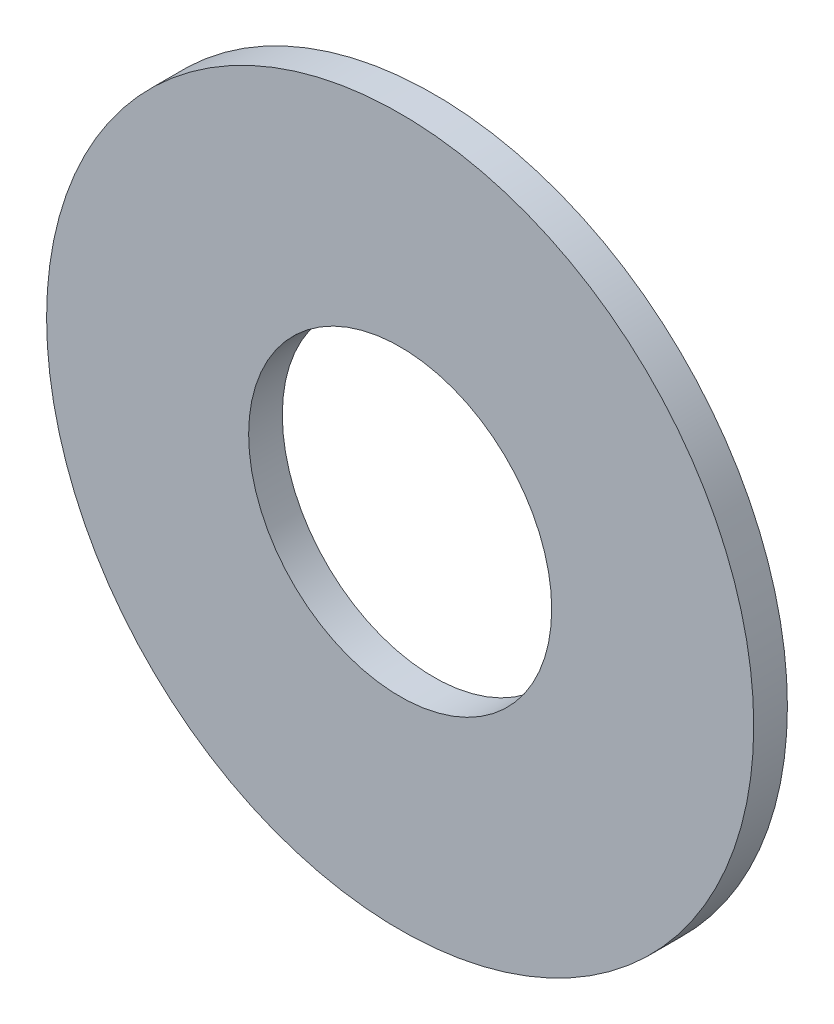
from build123d import *

# Parameters (mm, degrees)
ESQUISSE1_R      = 10.5
ESQUISSE1_R_2    = 4.5
EXTRUSION1_DEPTH = 1


with BuildPart() as part:
    # Esquisse1 → Extrusion1 (new body)
    with BuildSketch(Plane.XY):
        Circle(ESQUISSE1_R)
        Circle(ESQUISSE1_R_2, mode=Mode.SUBTRACT)
    extrude(amount=EXTRUSION1_DEPTH)


solid = part.part
